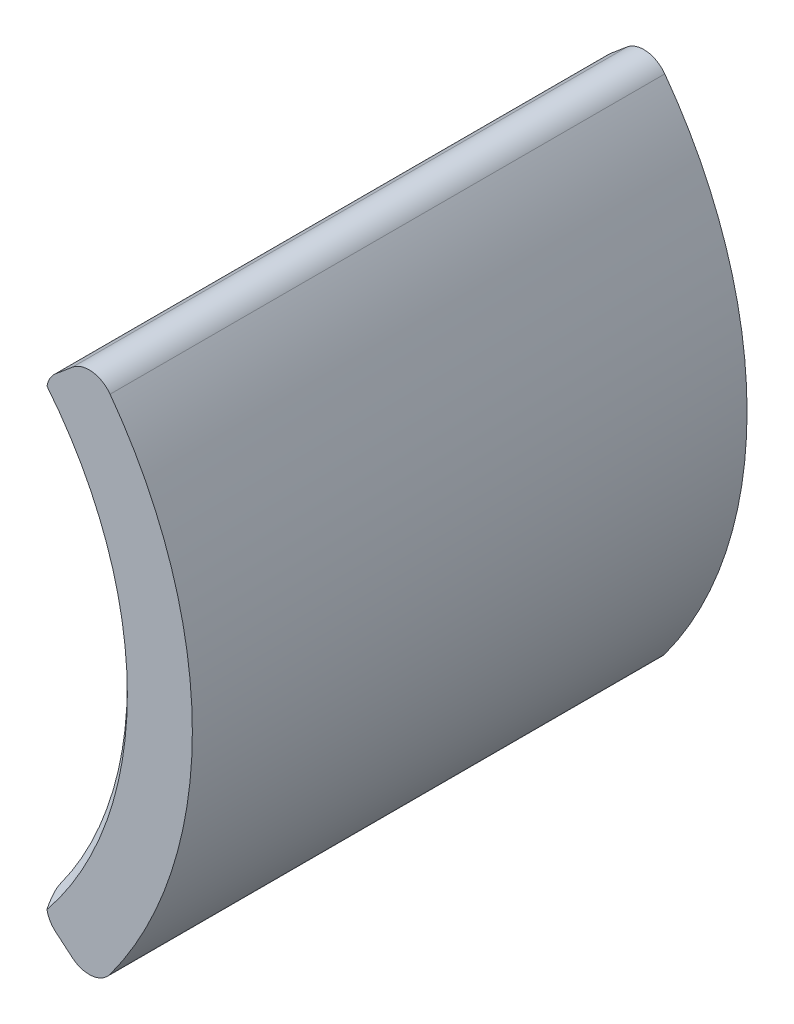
from build123d import *

# Parameters (mm, degrees)
EXTRUSION1_DEPTH = 64
CHANFREIN1_SIZE  = 1
CONG_1_R         = 3


with BuildPart() as part:
    # Esquisse1 → Extrusion1 (new body)
    with BuildSketch(Plane.XY):
        with BuildLine():
            Line((49, 0), (40.5, 0))
            ThreePointArc((40.5, 0), (38.05755114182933, 13.851815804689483), (31.024799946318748, 26.032898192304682))
            Line((31.024799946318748, 26.032898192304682), (37.53617771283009, 31.496592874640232))
            ThreePointArc((37.53617771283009, 31.496592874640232), (46.04493841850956, 16.758987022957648), (49, 0))
        make_face()
    extrusion1 = extrude(amount=EXTRUSION1_DEPTH)

    # Sym_trie1: Extrusion1 across plane
    add(extrusion1.mirror(Plane(origin=(49, 0, 64), x_dir=(0, 0, 1), z_dir=(0, 1, 0))))

    # Chanfrein1
    chanfrein1_edges = [part.edges().sort_by_distance(p)[0] for p in [
        (40.50000000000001, 3.55e-15, 64),
        (40.50000000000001, -3.55e-15, 0),
    ]]
    chamfer(chanfrein1_edges, length=CHANFREIN1_SIZE)

    # Cong_1
    cong_1_edges = [part.edges().sort_by_distance(p)[0] for p in [
        (31.02479994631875, 26.032898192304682, 32),
        (37.536177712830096, 31.496592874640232, 32),
        (37.536177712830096, -31.496592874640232, 32),
        (31.02479994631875, -26.032898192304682, 32),
    ]]
    fillet(cong_1_edges, radius=CONG_1_R)


solid = part.part
